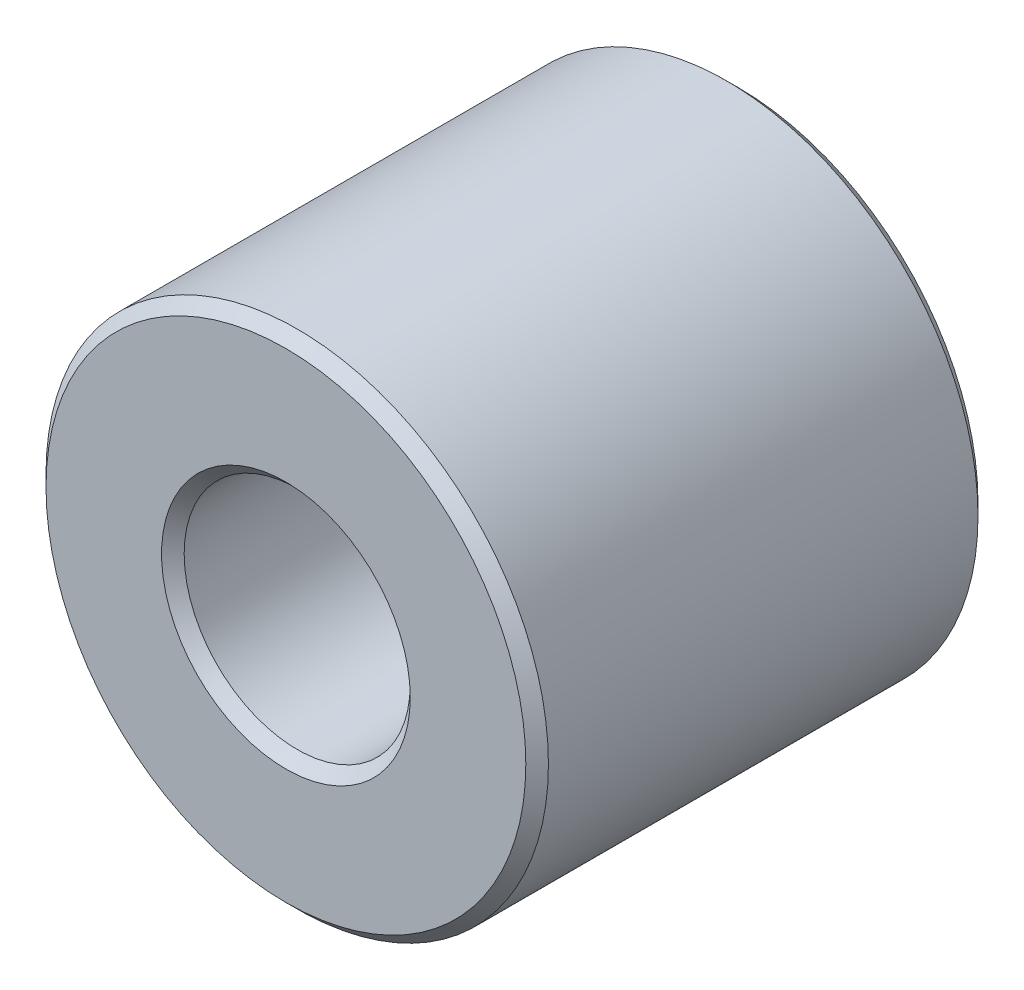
from build123d import *

# Parameters (mm, degrees)
SKETCH1_R           = 20
SKETCH1_R_2         = 9
BOSS_EXTRUDE1_DEPTH = 18
CHAMFER1_SIZE       = 0.9


with BuildPart() as part:
    # Sketch1 → Boss-Extrude1 (new, symmetric)
    with BuildSketch(Plane.XY):
        Circle(SKETCH1_R)
        Circle(SKETCH1_R_2, mode=Mode.SUBTRACT)
    extrude(amount=BOSS_EXTRUDE1_DEPTH, both=True)

    # Chamfer1
    chamfer1_edges = [part.edges().sort_by_distance(p)[0] for p in [
        (-20, 0, -18),
        (-20, 0, 18),
        (-9, 0, -18),
        (-9, 0, 18),
    ]]
    chamfer(chamfer1_edges, length=CHAMFER1_SIZE)


solid = part.part
